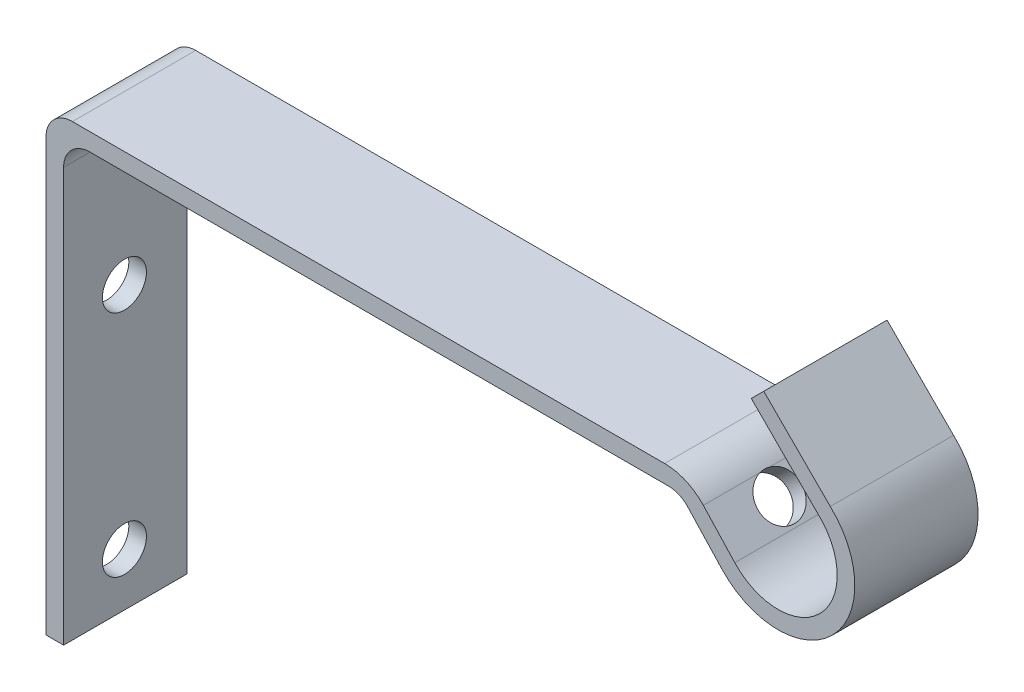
from build123d import *

# Parameters (mm, degrees)
EXTRUIR1_DEPTH        = 14
REDONDEO1_R           = 6
REDONDEO2_R           = 3
REDONDEO3_R           = 3
CROQUIS2_R            = 2.5
CORTAR_EXTRUIR1_DEPTH = 112.62923502
CROQUIS3_R            = 2.5
CORTAR_EXTRUIR2_DEPTH = 90.893435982
REDONDEO4_R           = 3


with BuildPart() as part:
    # Croquis1 → Extruir1 (new body)
    with BuildSketch(Plane.XY):
        with BuildLine():
            Line((0, 0), (0, 50))
            Line((0, 50), (70, 50))
            Line((70, 50), (74.762138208, 44.86949908))
            ThreePointArc((74.762138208, 44.86949908), (87.305232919, 44.63430557), (87.077024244, 57.177529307))
            Line((87.077024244, 57.177529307), (79.520169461, 64.734384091))
            Line((79.520169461, 64.734384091), (78.105955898, 63.320170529))
            Line((78.105955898, 63.320170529), (85.690426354, 55.735700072))
            ThreePointArc((85.690426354, 55.735700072), (85.903520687, 46.061044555), (76.227995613, 46.230109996))
            Line((76.227995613, 46.230109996), (71.465857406, 51.360610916))
            Line((71.465857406, 51.360610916), (70.872375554, 52))
            Line((70.872375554, 52), (70, 52))
            Line((70, 52), (-2, 52))
            Line((-2, 52), (-2, 0))
            Line((-2, 0), (0, 0))
        make_face()
    extrude(amount=EXTRUIR1_DEPTH)

    # Redondeo1
    redondeo1_edges = [part.edges().sort_by_distance(p)[0] for p in [
        (70.872375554, 52, 7),
    ]]
    fillet(redondeo1_edges, radius=REDONDEO1_R)

    # Redondeo2
    redondeo2_edges = [part.edges().sort_by_distance(p)[0] for p in [
        (-2, 52, 7),
    ]]
    fillet(redondeo2_edges, radius=REDONDEO2_R)

    # Redondeo3
    redondeo3_edges = [part.edges().sort_by_distance(p)[0] for p in [
        (0, 50, 7),
    ]]
    fillet(redondeo3_edges, radius=REDONDEO3_R)

    # Croquis2 → Cortar-Extruir1 (cut, through all)
    with BuildSketch(Plane(origin=(0, 0, 0), x_dir=(0, 0, -1), z_dir=(1, 0, 0))):
        with Locations((-7.093268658, 6)):
            Circle(CROQUIS2_R)
        with Locations((-7.093268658, 32)):
            Circle(CROQUIS2_R)
    extrude(amount=-CORTAR_EXTRUIR1_DEPTH, mode=Mode.SUBTRACT)

    # Croquis3 → Cortar-Extruir2 (cut, through all)
    with BuildSketch(Plane(origin=(63.999541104, 59.404464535, 0), x_dir=(0, 0, -1), z_dir=(0.732928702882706, 0.680305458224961, 0))):
        with Locations(Location((-7, -15.158743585, 0), (0, 0, 90))):
            Circle(CROQUIS3_R)
    extrude(amount=-CORTAR_EXTRUIR2_DEPTH, mode=Mode.SUBTRACT)

    # Redondeo4
    redondeo4_edges = [part.edges().sort_by_distance(p)[0] for p in [
        (70, 50, 7),
    ]]
    fillet(redondeo4_edges, radius=REDONDEO4_R)


solid = part.part
